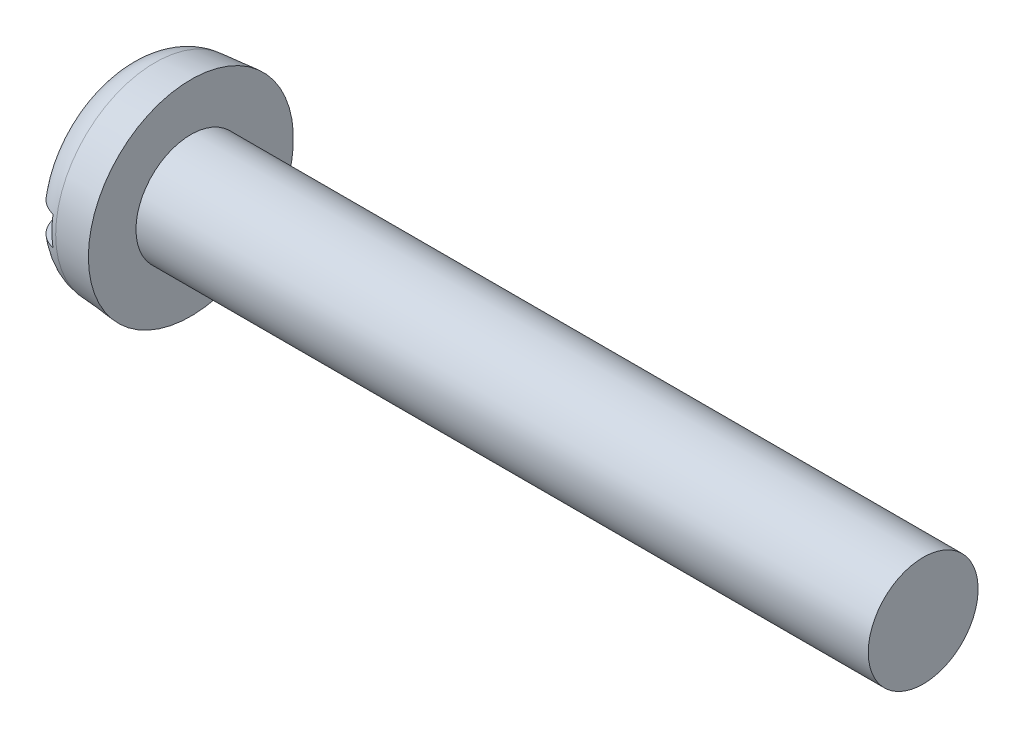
from build123d import *

# Parameters (mm, degrees)
FILLET2_R  = 0.9
SKETCH2_W  = 5.6
SKETCH2_H  = 0.8
SLOT_DEPTH = 0.7


with BuildPart() as part:
    # BodySke → Base-Revolve (revolve)
    with BuildSketch(Plane.XY, mode=Mode.PRIVATE) as base_revolve_sk:
        Polygon((1.8, 1.5), (1.8, 2.8), (0, 2.642520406), (0, 0), (21.8, 0), (21.8, 1.5), align=None)
    revolve(base_revolve_sk.sketch.rotate(Axis((-25.4, 0, 0), (1, 0, 0)), 90), axis=Axis((-25.4, 0, 0), (1, 0, 0)))

    # Fillet2
    fillet2_edges = [part.edges().sort_by_distance(p)[0] for p in [
        (0, 0, -2.642520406),
    ]]
    fillet(fillet2_edges, radius=FILLET2_R)

    # Sketch2 → Slot (cut)
    with BuildSketch(Plane(origin=(0, 0, 0), x_dir=(0, 0, -1), z_dir=(1, 0, 0))):
        Rectangle(SKETCH2_W, SKETCH2_H)
    extrude(amount=SLOT_DEPTH, mode=Mode.SUBTRACT)


solid = part.part
